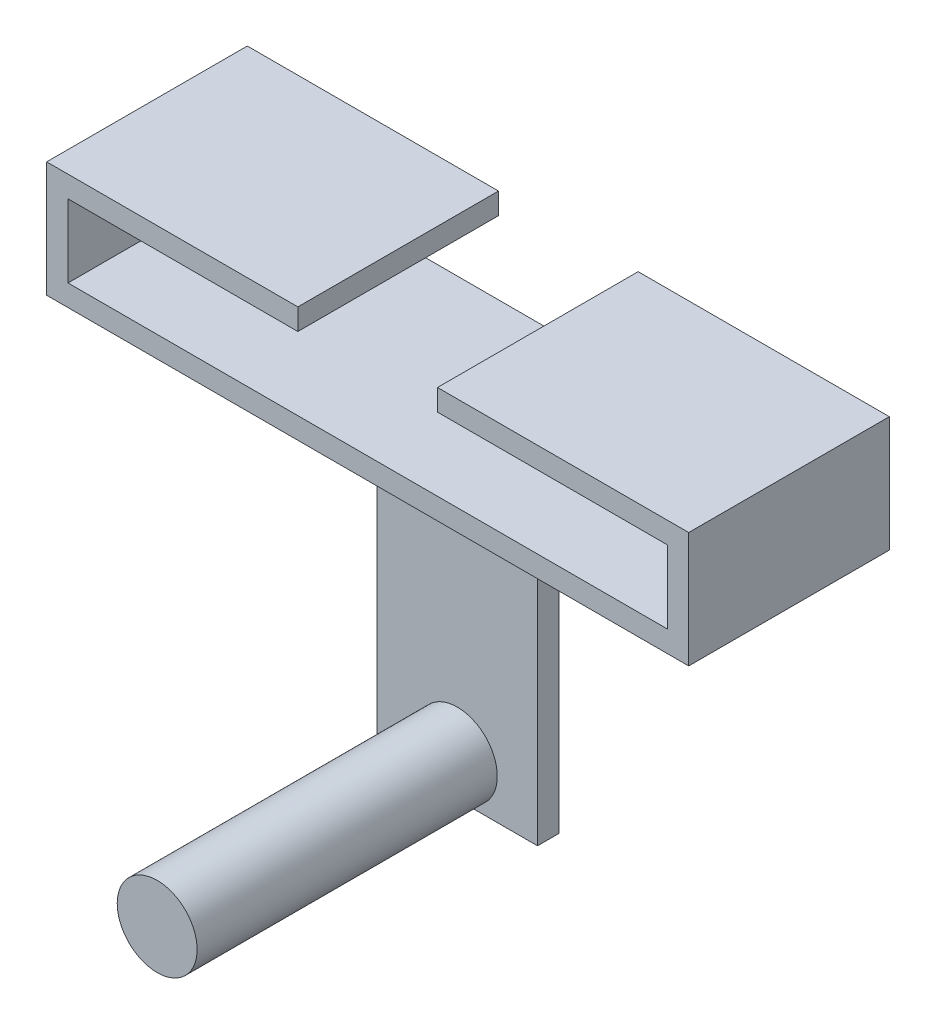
from build123d import *

# Parameters (mm, degrees)
SKETCH1_W           = 101.6
SKETCH1_H           = 31.75
BOSS_EXTRUDE1_DEPTH = 18.288
SKETCH2_W           = 22.098
SKETCH2_H           = 31.75
CUT_EXTRUDE1_DEPTH  = 14.9098
SKETCH3_W           = 36.3728
SKETCH3_H           = 11.5316
CUT_EXTRUDE2_DEPTH  = 109.004969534
SKETCH4_W           = 25.37968
SKETCH4_H           = 3.3782
BOSS_EXTRUDE2_DEPTH = 50.8
BOSS_EXTRUDE3_DEPTH = 47.498
BOSS_EXTRUDE4_DEPTH = 47.498


with BuildPart() as part:
    # Sketch1 → Boss-Extrude1 (new body)
    with BuildSketch(Plane(origin=(0, 0, 0), x_dir=(1, 0, 0), z_dir=(0, 1, 0))):
        with Locations((50.8, 15.875)):
            Rectangle(SKETCH1_W, SKETCH1_H)
    extrude(amount=BOSS_EXTRUDE1_DEPTH)

    # Sketch2 → Cut-Extrude1 (cut)
    with BuildSketch(Plane(origin=(0, 18.288, 0), x_dir=(1, 0, 0), z_dir=(0, 1, 0))):
        with Locations((50.8, 15.875)):
            Rectangle(SKETCH2_W, SKETCH2_H)
    extrude(amount=-CUT_EXTRUDE1_DEPTH, mode=Mode.SUBTRACT)

    # Sketch3 → Cut-Extrude2 (cut, through all)
    with BuildSketch(Plane.XY):
        with Locations((21.5646, 9.144)):
            Rectangle(SKETCH3_W, SKETCH3_H)
        with Locations((80.0354, 9.144)):
            Rectangle(SKETCH3_W, SKETCH3_H)
    extrude(amount=-CUT_EXTRUDE2_DEPTH, mode=Mode.SUBTRACT)

    # Sketch4 → Boss-Extrude2 (add)
    with BuildSketch(Plane.XZ):
        with Locations((50.8, -15.875)):
            Rectangle(SKETCH4_W, SKETCH4_H)
    extrude(amount=BOSS_EXTRUDE2_DEPTH)

    # Sketch5 → Boss-Extrude3 (add)
    with BuildSketch(Plane.XY.offset(-14.1859)):
        with BuildLine():
            Line((44.4754, -44.45), (57.1246, -44.45))
            ThreePointArc((57.1246, -44.45), (50.8, -38.1254), (44.4754, -44.45))
        make_face()
    extrude(amount=BOSS_EXTRUDE3_DEPTH)

    # Sketch8 → Boss-Extrude4 (add)
    with BuildSketch(Plane.XY.offset(-14.1859)):
        with BuildLine():
            Line((44.4754, -44.45), (57.1246, -44.45))
            ThreePointArc((57.1246, -44.45), (50.8, -50.7746), (44.4754, -44.45))
        make_face()
    extrude(amount=BOSS_EXTRUDE4_DEPTH)


solid = part.part
